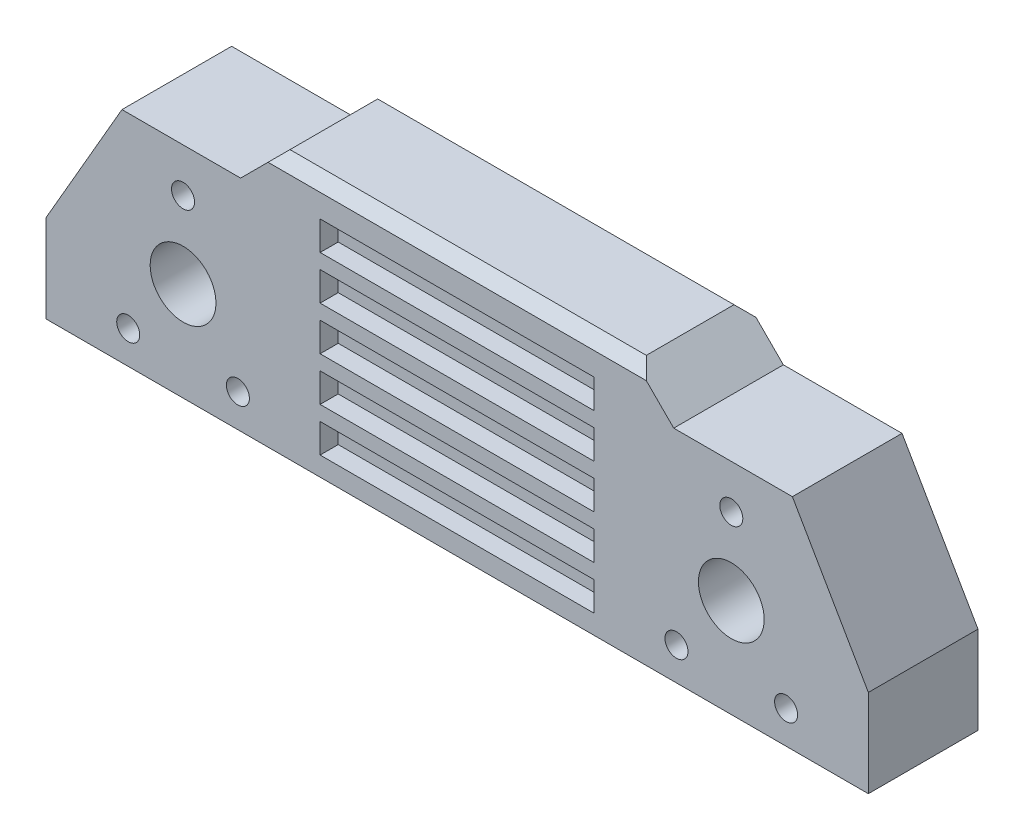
from build123d import *

# Parameters (mm, degrees)
SKETCH4_R                  = 6
BOSS_EXTRUDE2_DEPTH        = 10
M5_TAPPED_HOLE2_AT_2_COUNT = 2
M5_TAPPED_HOLE2_AT_2_PITCH = 27.856776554
M5_TAPPED_HOLE2_AT_3_COUNT = 2
M5_TAPPED_HOLE2_AT_3_PITCH = 27.856776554
CUT_EXTRUDE2_DEPTH         = 25
LPATTERN1_COUNT            = 5
LPATTERN1_PITCH            = 8
CHAMFER1_SIZE              = 2


with BuildPart() as part:
    # Sketch4 → Boss-Extrude2 (new, symmetric)
    with BuildSketch(Plane.XY):
        Polygon((-75, 0), (75, 0), (75, 16), (61.143593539, 40), (39.5, 40), (32.5, 47), (-32.5, 47), (-39.5, 40), (-61.143593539, 40), (-75, 16), align=None)
        with Locations((50, 18)):
            Circle(SKETCH4_R, mode=Mode.SUBTRACT)
        with Locations(Location((-50, 18, 0), (0, 0, 180))):
            Circle(SKETCH4_R, mode=Mode.SUBTRACT)
    extrude(amount=BOSS_EXTRUDE2_DEPTH, both=True)

    # Sketch9 → M5 Tapped Hole2 (revolve, cut)
    with BuildSketch(Plane(origin=(50, 32, 10), x_dir=(0, -1, 0), z_dir=(1, 0, 0))):
        Polygon((0, 0), (0, 15.2618073), (2.1, 14), (2.1, 0), align=None)
    m5_tapped_hole2 = revolve(axis=Axis((50, 32, 16.35), (0, 0, -1)), mode=Mode.SUBTRACT)

    # M5 Tapped Hole2 at 2: M5 Tapped Hole2 ×2
    with Locations(*[Vector(-0.35897907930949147, -0.9333456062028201, 0) * (i * M5_TAPPED_HOLE2_AT_2_PITCH) for i in range(1, M5_TAPPED_HOLE2_AT_2_COUNT)]):
        add(m5_tapped_hole2, mode=Mode.SUBTRACT)

    # M5 Tapped Hole2 at 3: M5 Tapped Hole2 ×2
    with Locations(*[Vector(0.35897907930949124, -0.9333456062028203, 0) * (i * M5_TAPPED_HOLE2_AT_3_PITCH) for i in range(1, M5_TAPPED_HOLE2_AT_3_COUNT)]):
        add(m5_tapped_hole2, mode=Mode.SUBTRACT)

    # Sketch10 → Cut-Extrude2 (cut, symmetric)
    with BuildSketch(Plane(origin=(0, 0, 0), x_dir=(0, 0, -1), z_dir=(1, 0, 0))):
        Polygon((-6.7, 3.5), (-6.7, 6.2), (-10, 8.8), (-10, 3.5), align=None)
    cut_extrude2 = extrude(amount=CUT_EXTRUDE2_DEPTH, both=True, mode=Mode.SUBTRACT)

    # LPattern1: Cut-Extrude2 ×5
    with Locations(*[(0, i * LPATTERN1_PITCH, 0) for i in range(1, LPATTERN1_COUNT)]):
        add(cut_extrude2, mode=Mode.SUBTRACT)

    # Chamfer1
    chamfer1_edges = [part.edges().sort_by_distance(p)[0] for p in [
        (0, 47, -10),
        (0, 47, 10),
    ]]
    chamfer(chamfer1_edges, length=CHAMFER1_SIZE)

    # Mirror2: M5 Tapped Hole2 across plane
    add(m5_tapped_hole2.mirror(Plane(origin=(0, 0, 0), x_dir=(0, 0, 1), z_dir=(1, 0, 0))), mode=Mode.SUBTRACT)

    # Mirror2 copy 1 sketch → Mirror2 copy 1 (revolve, cut)
    with BuildSketch(Plane(origin=(-40, 6, 10), x_dir=(0, -1, 0), z_dir=(-1, 0, 0))):
        Polygon((0, 0), (0, -15.2618073), (2.1, -14), (2.1, 0), align=None)
    revolve(axis=Axis((-40, 6, 16.35), (0, 0, 1)), mode=Mode.SUBTRACT)

    # Mirror2 copy 2 sketch → Mirror2 copy 2 (revolve, cut)
    with BuildSketch(Plane(origin=(-60, 6, 10), x_dir=(0, -1, 0), z_dir=(-1, 0, 0))):
        Polygon((0, 0), (0, -15.2618073), (2.1, -14), (2.1, 0), align=None)
    revolve(axis=Axis((-60, 6, 16.35), (0, 0, 1)), mode=Mode.SUBTRACT)


solid = part.part
